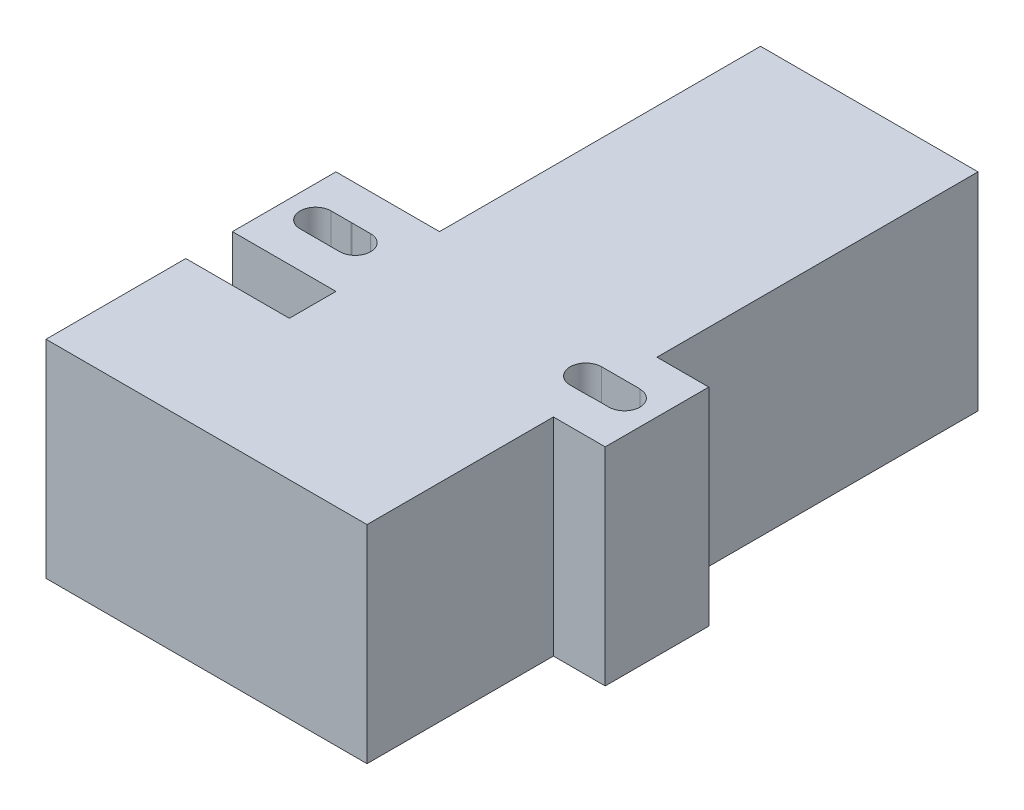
from build123d import *

# Parameters (mm, degrees)
SKETCH_1_W          = 21
SKETCH_1_H          = 59
EXTRUDE_1_DEPTH     = 20
SKETCH_2_W          = 7.5
SKETCH_2_H          = 10
EXTRUDE_2_DEPTH     = 20
SKETCH_3_W          = 31
SKETCH_3_H          = 13.5
EXTRUDE_4_DEPTH     = 20
SKETCH_5_W          = 2.5
SKETCH_5_H          = 10
EXTRUDE_5_DEPTH     = 20
SKETCH_6_W          = 2.5
SKETCH_6_H          = 10
CUT_EXTRUDE_1_DEPTH = 20
SKETCH_7_R          = 1.5
CUT_EXTRUDE_2_DEPTH = 20
CUT_EXTRUDE_3_DEPTH = 20
SKETCH_10_W         = 2.789996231
SKETCH_10_H         = 3.026212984
CUT_EXTRUDE_4_DEPTH = 21


with BuildPart() as part:
    # Sketch 1 → Extrude 1 (new body)
    with BuildSketch(Plane(origin=(0, 0, 0), x_dir=(1, 0, 0), z_dir=(0, 1, 0))):
        with Locations((10.5, 29.5)):
            Rectangle(SKETCH_1_W, SKETCH_1_H)
    extrude(amount=EXTRUDE_1_DEPTH)

    # Sketch 2 → Extrude 2 (add)
    with BuildSketch(Plane(origin=(0, 20, 0), x_dir=(1, 0, 0), z_dir=(0, 1, 0))):
        with Locations((-3.75, 23)):
            Rectangle(SKETCH_2_W, SKETCH_2_H)
        with Locations((24.75, 23)):
            Rectangle(SKETCH_2_W, SKETCH_2_H)
    extrude(amount=-EXTRUDE_2_DEPTH)

    # Sketch 3 → Extrude 4 (add)
    with BuildSketch(Plane(origin=(0, 20, 0), x_dir=(1, 0, 0), z_dir=(0, 1, 0))):
        with Locations((5.5, 6.75)):
            Rectangle(SKETCH_3_W, SKETCH_3_H)
    extrude(amount=-EXTRUDE_4_DEPTH)

    # Sketch 5 → Extrude 5 (add)
    with BuildSketch(Plane(origin=(0, 20, 0), x_dir=(1, 0, 0), z_dir=(0, 1, 0))):
        with Locations((-8.75, 23)):
            Rectangle(SKETCH_5_W, SKETCH_5_H)
    extrude(amount=-EXTRUDE_5_DEPTH)

    # Sketch 6 → Cut-Extrude 1 (cut)
    with BuildSketch(Plane(origin=(0, 20, 0), x_dir=(1, 0, 0), z_dir=(0, 1, 0))):
        with Locations((27.25, 23)):
            Rectangle(SKETCH_6_W, SKETCH_6_H)
    extrude(amount=-CUT_EXTRUDE_1_DEPTH, mode=Mode.SUBTRACT)

    # Sketch 7 → Cut-Extrude 2 (cut)
    with BuildSketch(Plane(origin=(0, 20, 0), x_dir=(1, 0, 0), z_dir=(0, 1, 0))):
        with Locations(Location((-5, 23, 0), (0, 0, 270))):
            Circle(SKETCH_7_R)
        with Locations(Location((21, 23, 0), (0, 0, 270))):
            Circle(SKETCH_7_R)
    extrude(amount=-CUT_EXTRUDE_2_DEPTH, mode=Mode.SUBTRACT)

    # Sketch 9 → Cut-Extrude 3 (cut)
    with BuildSketch(Plane(origin=(0, 20, 0), x_dir=(1, 0, 0), z_dir=(0, 1, 0))):
        with BuildLine():
            ThreePointArc((-5.029037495, 21.500281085), (-6.5, 23), (-5.029037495, 24.499718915))
            Line((-5.029037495, 24.499718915), (-6.9651396, 24.499718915))
            ThreePointArc((-6.9651396, 24.499718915), (-8.464858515, 23), (-6.9651396, 21.500281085))
            Line((-6.9651396, 21.500281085), (-5.029037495, 21.500281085))
        make_face()
        with BuildLine():
            Line((22.858246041, 24.499718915), (21.28465298, 24.499718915))
            ThreePointArc((21.28465298, 24.499718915), (22.526494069, 23), (21.28465298, 21.500281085))
            Line((21.28465298, 21.500281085), (22.858246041, 21.500281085))
            ThreePointArc((22.858246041, 21.500281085), (24.357964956, 23), (22.858246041, 24.499718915))
        make_face()
        with BuildLine():
            ThreePointArc((21.029037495, 21.500281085), (19.5, 23), (21.029037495, 24.499718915))
            Line((21.029037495, 24.499718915), (21.28465298, 24.499718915))
            ThreePointArc((21.28465298, 24.499718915), (21.142954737, 24.519785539), (21, 24.526494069))
            Line((21, 24.526494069), (19.13649962, 24.526494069))
            ThreePointArc((19.13649962, 24.526494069), (17.610005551, 23), (19.13649962, 21.473505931))
            Line((19.13649962, 21.473505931), (21, 21.473505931))
            ThreePointArc((21, 21.473505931), (21.142954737, 21.480214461), (21.28465298, 21.500281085))
            Line((21.28465298, 21.500281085), (21.029037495, 21.500281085))
        make_face()
        with BuildLine():
            ThreePointArc((-3.140428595, 21.500281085), (-1.64070968, 23), (-3.140428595, 24.499718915))
            Line((-3.140428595, 24.499718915), (-5, 24.499718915))
            ThreePointArc((-5, 24.499718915), (-6.499718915, 23), (-5, 21.500281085))
            Line((-5, 21.500281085), (-3.140428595, 21.500281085))
        make_face()
    extrude(amount=-CUT_EXTRUDE_3_DEPTH, mode=Mode.SUBTRACT)


with BuildPart() as cut_extrude_3_piece_1:
    # of the separate pieces the step leaves, piece 1, a body of its own (cut_extrude_3_pieces)
    add(part.part.solids().sort_by_distance((21, 0, 0))[0])


with BuildPart() as cut_extrude_3_piece_2:
    # of the separate pieces the step leaves, piece 2, a body of its own (cut_extrude_3_pieces)
    add(part.part.solids().sort_by_distance((21.029037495, 0, -21.500281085))[0])


with BuildPart() as cut_extrude_4_tool:
    # Sketch 10 → Cut-Extrude 4 (new body)
    with BuildSketch(Plane(origin=(0, 20, 0), x_dir=(1, 0, 0), z_dir=(0, 1, 0))):
        with Locations((21.463247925, 23.013387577)):
            Rectangle(SKETCH_10_W, SKETCH_10_H)
    extrude(amount=-CUT_EXTRUDE_4_DEPTH)


with BuildPart() as cut_extrude_3_piece_1_1:
    add(cut_extrude_3_piece_1.part)

    # Cut-Extrude 4: cut by cut_extrude_4_tool
    add(cut_extrude_4_tool.part, mode=Mode.SUBTRACT)


with BuildPart() as cut_extrude_3_piece_2_1:
    add(cut_extrude_3_piece_2.part)

    # Cut-Extrude 4: cut by cut_extrude_4_tool
    add(cut_extrude_4_tool.part, mode=Mode.SUBTRACT)


solid = cut_extrude_3_piece_1_1.part
